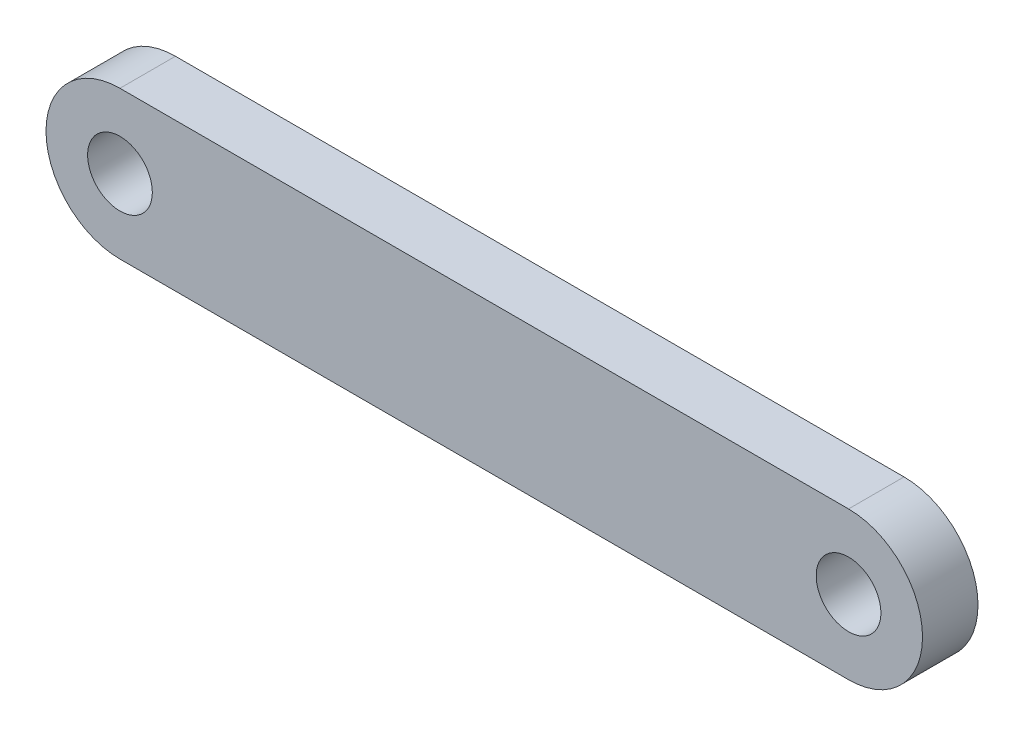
ISO-10303-21;
HEADER;
FILE_DESCRIPTION(('STEP AP214'),'2;1');
FILE_NAME('part.step','',(''),(''),'','','');
FILE_SCHEMA(('AUTOMOTIVE_DESIGN { 1 0 10303 214 1 1 1 1 }'));
ENDSEC;
DATA;
#1=APPLICATION_CONTEXT('core data for automotive mechanical design processes');
#2=APPLICATION_PROTOCOL_DEFINITION('international standard','automotive_design',2000,#1);
#3=PRODUCT_CONTEXT('',#1,'mechanical');
#4=PRODUCT('Part','Part','',(#3));
#5=PRODUCT_RELATED_PRODUCT_CATEGORY('part','',(#4));
#6=PRODUCT_DEFINITION_FORMATION('','',#4);
#7=PRODUCT_DEFINITION_CONTEXT('part definition',#1,'design');
#8=PRODUCT_DEFINITION('design','',#6,#7);
#9=PRODUCT_DEFINITION_SHAPE('','',#8);
#10=(LENGTH_UNIT() NAMED_UNIT(*) SI_UNIT(.MILLI.,.METRE.));
#11=(NAMED_UNIT(*) PLANE_ANGLE_UNIT() SI_UNIT($,.RADIAN.));
#12=(NAMED_UNIT(*) SI_UNIT($,.STERADIAN.) SOLID_ANGLE_UNIT());
#13=UNCERTAINTY_MEASURE_WITH_UNIT(LENGTH_MEASURE(1.E-05),#10,'distance_accuracy_value','');
#14=(GEOMETRIC_REPRESENTATION_CONTEXT(3) GLOBAL_UNCERTAINTY_ASSIGNED_CONTEXT((#13)) GLOBAL_UNIT_ASSIGNED_CONTEXT((#10,
#11,#12)) REPRESENTATION_CONTEXT('',''));
#15=CARTESIAN_POINT('',(0.,0.,0.));
#16=DIRECTION('',(0.,0.,1.));
#17=DIRECTION('',(1.,0.,0.));
#18=AXIS2_PLACEMENT_3D('',#15,#16,#17);
#19=CARTESIAN_POINT('',(0.,4.,3.));
#20=DIRECTION('',(0.,1.,0.));
#21=DIRECTION('',(-1.,0.,0.));
#22=AXIS2_PLACEMENT_3D('',#19,#20,#21);
#23=PLANE('',#22);
#24=DIRECTION('',(1.,0.,0.));
#25=VECTOR('',#24,1.);
#26=CARTESIAN_POINT('',(0.,4.,0.));
#27=LINE('',#26,#25);
#28=CARTESIAN_POINT('',(-39.4,4.00000000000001,0.));
#29=VERTEX_POINT('',#28);
#30=CARTESIAN_POINT('',(0.,4.,0.));
#31=VERTEX_POINT('',#30);
#32=EDGE_CURVE('E105',#29,#31,#27,.T.);
#33=ORIENTED_EDGE('',*,*,#32,.F.);
#34=DIRECTION('',(0.,0.,-1.));
#35=VECTOR('',#34,1.);
#36=CARTESIAN_POINT('',(-39.4,4.00000000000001,3.));
#37=LINE('',#36,#35);
#38=CARTESIAN_POINT('',(-39.4,4.00000000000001,3.));
#39=VERTEX_POINT('',#38);
#40=EDGE_CURVE('E11',#39,#29,#37,.T.);
#41=ORIENTED_EDGE('',*,*,#40,.F.);
#42=DIRECTION('',(1.,0.,0.));
#43=VECTOR('',#42,1.);
#44=CARTESIAN_POINT('',(0.,4.,3.));
#45=LINE('',#44,#43);
#46=CARTESIAN_POINT('',(0.,4.,3.));
#47=VERTEX_POINT('',#46);
#48=EDGE_CURVE('E91',#39,#47,#45,.T.);
#49=ORIENTED_EDGE('',*,*,#48,.T.);
#50=DIRECTION('',(0.,0.,-1.));
#51=VECTOR('',#50,1.);
#52=CARTESIAN_POINT('',(0.,4.,3.));
#53=LINE('',#52,#51);
#54=EDGE_CURVE('E73',#47,#31,#53,.T.);
#55=ORIENTED_EDGE('',*,*,#54,.T.);
#56=EDGE_LOOP('',(#33,#41,#49,#55));
#57=FACE_BOUND('',#56,.T.);
#58=ADVANCED_FACE('F34',(#57),#23,.T.);
#59=CARTESIAN_POINT('',(-39.4,0.,3.));
#60=DIRECTION('',(0.,0.,-1.));
#61=DIRECTION('',(-1.,0.,0.));
#62=AXIS2_PLACEMENT_3D('',#59,#60,#61);
#63=CYLINDRICAL_SURFACE('',#62,4.00000000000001);
#64=CARTESIAN_POINT('',(-39.4,0.,0.));
#65=DIRECTION('',(0.,0.,1.));
#66=DIRECTION('',(1.,0.,0.));
#67=AXIS2_PLACEMENT_3D('',#64,#65,#66);
#68=CIRCLE('',#67,4.00000000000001);
#69=CARTESIAN_POINT('',(-39.4,-4.00000000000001,0.));
#70=VERTEX_POINT('',#69);
#71=EDGE_CURVE('E96',#29,#70,#68,.T.);
#72=ORIENTED_EDGE('',*,*,#71,.T.);
#73=DIRECTION('',(0.,0.,-1.));
#74=VECTOR('',#73,1.);
#75=CARTESIAN_POINT('',(-39.4,-4.00000000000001,3.));
#76=LINE('',#75,#74);
#77=CARTESIAN_POINT('',(-39.4,-4.00000000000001,3.));
#78=VERTEX_POINT('',#77);
#79=EDGE_CURVE('E43',#78,#70,#76,.T.);
#80=ORIENTED_EDGE('',*,*,#79,.F.);
#81=CARTESIAN_POINT('',(-39.4,0.,3.));
#82=DIRECTION('',(0.,0.,1.));
#83=DIRECTION('',(1.,0.,0.));
#84=AXIS2_PLACEMENT_3D('',#81,#82,#83);
#85=CIRCLE('',#84,4.00000000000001);
#86=EDGE_CURVE('E88',#39,#78,#85,.T.);
#87=ORIENTED_EDGE('',*,*,#86,.F.);
#88=ORIENTED_EDGE('',*,*,#40,.T.);
#89=EDGE_LOOP('',(#72,#80,#87,#88));
#90=FACE_BOUND('',#89,.T.);
#91=ADVANCED_FACE('F94',(#90),#63,.T.);
#92=CARTESIAN_POINT('',(0.,-4.,3.));
#93=DIRECTION('',(0.,1.,0.));
#94=DIRECTION('',(-1.,0.,0.));
#95=AXIS2_PLACEMENT_3D('',#92,#93,#94);
#96=PLANE('',#95);
#97=DIRECTION('',(1.,0.,0.));
#98=VECTOR('',#97,1.);
#99=CARTESIAN_POINT('',(0.,-4.,0.));
#100=LINE('',#99,#98);
#101=CARTESIAN_POINT('',(0.,-4.,0.));
#102=VERTEX_POINT('',#101);
#103=EDGE_CURVE('E102',#70,#102,#100,.T.);
#104=ORIENTED_EDGE('',*,*,#103,.T.);
#105=DIRECTION('',(0.,0.,-1.));
#106=VECTOR('',#105,1.);
#107=CARTESIAN_POINT('',(0.,-4.,3.));
#108=LINE('',#107,#106);
#109=CARTESIAN_POINT('',(0.,-4.,3.));
#110=VERTEX_POINT('',#109);
#111=EDGE_CURVE('E87',#110,#102,#108,.T.);
#112=ORIENTED_EDGE('',*,*,#111,.F.);
#113=DIRECTION('',(1.,0.,0.));
#114=VECTOR('',#113,1.);
#115=CARTESIAN_POINT('',(0.,-4.,3.));
#116=LINE('',#115,#114);
#117=EDGE_CURVE('E81',#78,#110,#116,.T.);
#118=ORIENTED_EDGE('',*,*,#117,.F.);
#119=ORIENTED_EDGE('',*,*,#79,.T.);
#120=EDGE_LOOP('',(#104,#112,#118,#119));
#121=FACE_BOUND('',#120,.T.);
#122=ADVANCED_FACE('F84',(#121),#96,.F.);
#123=CARTESIAN_POINT('',(0.,0.,3.));
#124=DIRECTION('',(0.,0.,-1.));
#125=DIRECTION('',(-1.,0.,0.));
#126=AXIS2_PLACEMENT_3D('',#123,#124,#125);
#127=CYLINDRICAL_SURFACE('',#126,1.75);
#128=CARTESIAN_POINT('',(0.,0.,3.));
#129=DIRECTION('',(0.,0.,1.));
#130=DIRECTION('',(1.,0.,0.));
#131=AXIS2_PLACEMENT_3D('',#128,#129,#130);
#132=CIRCLE('',#131,1.75);
#133=CARTESIAN_POINT('',(1.75,0.,3.));
#134=VERTEX_POINT('',#133);
#135=EDGE_CURVE('E115',#134,#134,#132,.T.);
#136=ORIENTED_EDGE('',*,*,#135,.T.);
#137=EDGE_LOOP('',(#136));
#138=FACE_BOUND('',#137,.T.);
#139=CARTESIAN_POINT('',(0.,0.,0.));
#140=DIRECTION('',(0.,0.,1.));
#141=DIRECTION('',(1.,0.,0.));
#142=AXIS2_PLACEMENT_3D('',#139,#140,#141);
#143=CIRCLE('',#142,1.75);
#144=CARTESIAN_POINT('',(1.75,0.,0.));
#145=VERTEX_POINT('',#144);
#146=EDGE_CURVE('E107',#145,#145,#143,.T.);
#147=ORIENTED_EDGE('',*,*,#146,.F.);
#148=EDGE_LOOP('',(#147));
#149=FACE_BOUND('',#148,.T.);
#150=ADVANCED_FACE('F130',(#138,#149),#127,.F.);
#151=CARTESIAN_POINT('',(-39.4,0.,3.));
#152=DIRECTION('',(0.,0.,-1.));
#153=DIRECTION('',(-1.,0.,0.));
#154=AXIS2_PLACEMENT_3D('',#151,#152,#153);
#155=CYLINDRICAL_SURFACE('',#154,1.75);
#156=CARTESIAN_POINT('',(-39.4,0.,3.));
#157=DIRECTION('',(0.,0.,1.));
#158=DIRECTION('',(1.,0.,0.));
#159=AXIS2_PLACEMENT_3D('',#156,#157,#158);
#160=CIRCLE('',#159,1.75);
#161=CARTESIAN_POINT('',(-37.65,0.,3.));
#162=VERTEX_POINT('',#161);
#163=EDGE_CURVE('E101',#162,#162,#160,.T.);
#164=ORIENTED_EDGE('',*,*,#163,.T.);
#165=EDGE_LOOP('',(#164));
#166=FACE_BOUND('',#165,.T.);
#167=CARTESIAN_POINT('',(-39.4,0.,0.));
#168=DIRECTION('',(0.,0.,1.));
#169=DIRECTION('',(1.,0.,0.));
#170=AXIS2_PLACEMENT_3D('',#167,#168,#169);
#171=CIRCLE('',#170,1.75);
#172=CARTESIAN_POINT('',(-37.65,0.,0.));
#173=VERTEX_POINT('',#172);
#174=EDGE_CURVE('E110',#173,#173,#171,.T.);
#175=ORIENTED_EDGE('',*,*,#174,.F.);
#176=EDGE_LOOP('',(#175));
#177=FACE_BOUND('',#176,.T.);
#178=ADVANCED_FACE('F36',(#166,#177),#155,.F.);
#179=CARTESIAN_POINT('',(0.,0.,3.));
#180=DIRECTION('',(0.,0.,-1.));
#181=DIRECTION('',(-1.,0.,0.));
#182=AXIS2_PLACEMENT_3D('',#179,#180,#181);
#183=CYLINDRICAL_SURFACE('',#182,4.);
#184=CARTESIAN_POINT('',(0.,0.,0.));
#185=DIRECTION('',(0.,0.,1.));
#186=DIRECTION('',(1.,0.,0.));
#187=AXIS2_PLACEMENT_3D('',#184,#185,#186);
#188=CIRCLE('',#187,4.);
#189=EDGE_CURVE('E66',#102,#31,#188,.T.);
#190=ORIENTED_EDGE('',*,*,#189,.T.);
#191=ORIENTED_EDGE('',*,*,#54,.F.);
#192=CARTESIAN_POINT('',(0.,0.,3.));
#193=DIRECTION('',(0.,0.,1.));
#194=DIRECTION('',(1.,0.,0.));
#195=AXIS2_PLACEMENT_3D('',#192,#193,#194);
#196=CIRCLE('',#195,4.);
#197=EDGE_CURVE('E51',#110,#47,#196,.T.);
#198=ORIENTED_EDGE('',*,*,#197,.F.);
#199=ORIENTED_EDGE('',*,*,#111,.T.);
#200=EDGE_LOOP('',(#190,#191,#198,#199));
#201=FACE_BOUND('',#200,.T.);
#202=ADVANCED_FACE('F126',(#201),#183,.T.);
#203=CARTESIAN_POINT('',(0.,0.,3.));
#204=DIRECTION('',(0.,0.,1.));
#205=DIRECTION('',(1.,0.,0.));
#206=AXIS2_PLACEMENT_3D('',#203,#204,#205);
#207=PLANE('',#206);
#208=ORIENTED_EDGE('',*,*,#163,.F.);
#209=EDGE_LOOP('',(#208));
#210=FACE_BOUND('',#209,.T.);
#211=ORIENTED_EDGE('',*,*,#135,.F.);
#212=EDGE_LOOP('',(#211));
#213=FACE_BOUND('',#212,.T.);
#214=ORIENTED_EDGE('',*,*,#48,.F.);
#215=ORIENTED_EDGE('',*,*,#86,.T.);
#216=ORIENTED_EDGE('',*,*,#117,.T.);
#217=ORIENTED_EDGE('',*,*,#197,.T.);
#218=EDGE_LOOP('',(#214,#215,#216,#217));
#219=FACE_BOUND('',#218,.T.);
#220=ADVANCED_FACE('F90',(#210,#213,#219),#207,.T.);
#221=CARTESIAN_POINT('',(0.,0.,0.));
#222=DIRECTION('',(0.,0.,1.));
#223=DIRECTION('',(1.,0.,0.));
#224=AXIS2_PLACEMENT_3D('',#221,#222,#223);
#225=PLANE('',#224);
#226=ORIENTED_EDGE('',*,*,#174,.T.);
#227=EDGE_LOOP('',(#226));
#228=FACE_BOUND('',#227,.T.);
#229=ORIENTED_EDGE('',*,*,#146,.T.);
#230=EDGE_LOOP('',(#229));
#231=FACE_BOUND('',#230,.T.);
#232=ORIENTED_EDGE('',*,*,#32,.T.);
#233=ORIENTED_EDGE('',*,*,#189,.F.);
#234=ORIENTED_EDGE('',*,*,#103,.F.);
#235=ORIENTED_EDGE('',*,*,#71,.F.);
#236=EDGE_LOOP('',(#232,#233,#234,#235));
#237=FACE_BOUND('',#236,.T.);
#238=ADVANCED_FACE('F125',(#228,#231,#237),#225,.F.);
#239=CLOSED_SHELL('',(#58,#91,#122,#150,#178,#202,#220,#238));
#240=MANIFOLD_SOLID_BREP('B2',#239);
#241=ADVANCED_BREP_SHAPE_REPRESENTATION('',(#18,#240),#14);
#242=SHAPE_DEFINITION_REPRESENTATION(#9,#241);
ENDSEC;
END-ISO-10303-21;
